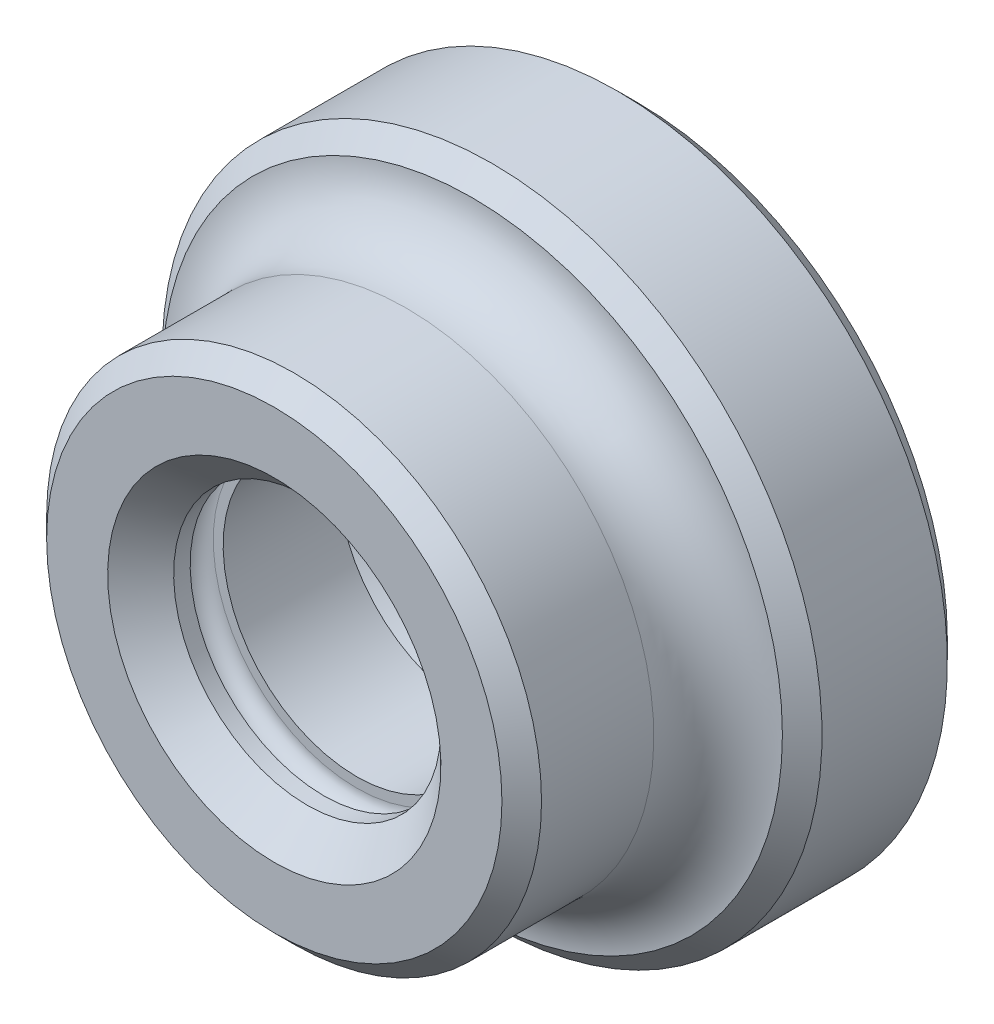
ISO-10303-21;
HEADER;
FILE_DESCRIPTION(('STEP AP214'),'2;1');
FILE_NAME('part.step','',(''),(''),'','','');
FILE_SCHEMA(('AUTOMOTIVE_DESIGN { 1 0 10303 214 1 1 1 1 }'));
ENDSEC;
DATA;
#1=APPLICATION_CONTEXT('core data for automotive mechanical design processes');
#2=APPLICATION_PROTOCOL_DEFINITION('international standard','automotive_design',2000,#1);
#3=PRODUCT_CONTEXT('',#1,'mechanical');
#4=PRODUCT('Part','Part','',(#3));
#5=PRODUCT_RELATED_PRODUCT_CATEGORY('part','',(#4));
#6=PRODUCT_DEFINITION_FORMATION('','',#4);
#7=PRODUCT_DEFINITION_CONTEXT('part definition',#1,'design');
#8=PRODUCT_DEFINITION('design','',#6,#7);
#9=PRODUCT_DEFINITION_SHAPE('','',#8);
#10=(LENGTH_UNIT() NAMED_UNIT(*) SI_UNIT(.MILLI.,.METRE.));
#11=(NAMED_UNIT(*) PLANE_ANGLE_UNIT() SI_UNIT($,.RADIAN.));
#12=(NAMED_UNIT(*) SI_UNIT($,.STERADIAN.) SOLID_ANGLE_UNIT());
#13=UNCERTAINTY_MEASURE_WITH_UNIT(LENGTH_MEASURE(1.E-05),#10,'distance_accuracy_value','');
#14=(GEOMETRIC_REPRESENTATION_CONTEXT(3) GLOBAL_UNCERTAINTY_ASSIGNED_CONTEXT((#13)) GLOBAL_UNIT_ASSIGNED_CONTEXT((#10,
#11,#12)) REPRESENTATION_CONTEXT('',''));
#15=CARTESIAN_POINT('',(0.,0.,0.));
#16=DIRECTION('',(0.,0.,1.));
#17=DIRECTION('',(1.,0.,0.));
#18=AXIS2_PLACEMENT_3D('',#15,#16,#17);
#19=CARTESIAN_POINT('',(0.,0.,4.99999999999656));
#20=DIRECTION('',(0.,0.,1.));
#21=DIRECTION('',(0.,-1.,0.));
#22=AXIS2_PLACEMENT_3D('',#19,#20,#21);
#23=CONICAL_SURFACE('',#22,4.05000000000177,1.02974425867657);
#24=CARTESIAN_POINT('',(0.,2.22044604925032E-13,2.56651449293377));
#25=VERTEX_POINT('',#24);
#26=VERTEX_LOOP('',#25);
#27=FACE_BOUND('',#26,.T.);
#28=CARTESIAN_POINT('',(0.,0.,5.));
#29=DIRECTION('',(0.,0.,1.));
#30=DIRECTION('',(0.,-1.,0.));
#31=AXIS2_PLACEMENT_3D('',#28,#29,#30);
#32=CIRCLE('',#31,4.05);
#33=CARTESIAN_POINT('',(0.,-4.05,5.));
#34=VERTEX_POINT('',#33);
#35=EDGE_CURVE('E30',#34,#34,#32,.T.);
#36=ORIENTED_EDGE('',*,*,#35,.T.);
#37=EDGE_LOOP('',(#36));
#38=FACE_BOUND('',#37,.T.);
#39=ADVANCED_FACE('F14',(#27,#38),#23,.F.);
#40=CARTESIAN_POINT('',(0.,0.,0.));
#41=DIRECTION('',(0.,0.,1.));
#42=DIRECTION('',(0.,-1.,0.));
#43=AXIS2_PLACEMENT_3D('',#40,#41,#42);
#44=CYLINDRICAL_SURFACE('',#43,4.05);
#45=ORIENTED_EDGE('',*,*,#35,.F.);
#46=EDGE_LOOP('',(#45));
#47=FACE_BOUND('',#46,.T.);
#48=CARTESIAN_POINT('',(0.,0.,8.5));
#49=DIRECTION('',(0.,0.,1.));
#50=DIRECTION('',(0.,-1.,0.));
#51=AXIS2_PLACEMENT_3D('',#48,#49,#50);
#52=CIRCLE('',#51,4.05);
#53=CARTESIAN_POINT('',(0.,-4.05,8.5));
#54=VERTEX_POINT('',#53);
#55=EDGE_CURVE('E17',#54,#54,#52,.T.);
#56=ORIENTED_EDGE('',*,*,#55,.T.);
#57=EDGE_LOOP('',(#56));
#58=FACE_BOUND('',#57,.T.);
#59=ADVANCED_FACE('F27',(#47,#58),#44,.F.);
#60=CARTESIAN_POINT('',(4.05,0.,8.5));
#61=DIRECTION('',(0.,0.,-1.));
#62=DIRECTION('',(0.,1.,0.));
#63=AXIS2_PLACEMENT_3D('',#60,#61,#62);
#64=PLANE('',#63);
#65=ORIENTED_EDGE('',*,*,#55,.F.);
#66=EDGE_LOOP('',(#65));
#67=FACE_BOUND('',#66,.T.);
#68=CARTESIAN_POINT('',(0.,0.,8.5));
#69=DIRECTION('',(0.,0.,-1.));
#70=DIRECTION('',(0.,1.,0.));
#71=AXIS2_PLACEMENT_3D('',#68,#69,#70);
#72=CIRCLE('',#71,4.35);
#73=CARTESIAN_POINT('',(0.,4.35,8.5));
#74=VERTEX_POINT('',#73);
#75=EDGE_CURVE('E34',#74,#74,#72,.F.);
#76=ORIENTED_EDGE('',*,*,#75,.T.);
#77=EDGE_LOOP('',(#76));
#78=FACE_BOUND('',#77,.T.);
#79=ADVANCED_FACE('F76',(#67,#78),#64,.F.);
#80=CARTESIAN_POINT('',(0.,0.,9.));
#81=DIRECTION('',(0.,0.,-1.));
#82=DIRECTION('',(0.,1.,0.));
#83=AXIS2_PLACEMENT_3D('',#80,#81,#82);
#84=TOROIDAL_SURFACE('',#83,4.35,0.5);
#85=ORIENTED_EDGE('',*,*,#75,.F.);
#86=EDGE_LOOP('',(#85));
#87=FACE_BOUND('',#86,.T.);
#88=CARTESIAN_POINT('',(0.,0.,9.5));
#89=DIRECTION('',(0.,0.,1.));
#90=DIRECTION('',(0.,1.,0.));
#91=AXIS2_PLACEMENT_3D('',#88,#89,#90);
#92=CIRCLE('',#91,4.35);
#93=CARTESIAN_POINT('',(0.,4.35,9.5));
#94=VERTEX_POINT('',#93);
#95=EDGE_CURVE('E63',#94,#94,#92,.T.);
#96=ORIENTED_EDGE('',*,*,#95,.T.);
#97=EDGE_LOOP('',(#96));
#98=FACE_BOUND('',#97,.T.);
#99=ADVANCED_FACE('F92',(#87,#98),#84,.F.);
#100=CARTESIAN_POINT('',(4.35,0.,9.5));
#101=DIRECTION('',(0.,0.,1.));
#102=DIRECTION('',(0.,-1.,0.));
#103=AXIS2_PLACEMENT_3D('',#100,#101,#102);
#104=PLANE('',#103);
#105=ORIENTED_EDGE('',*,*,#95,.F.);
#106=EDGE_LOOP('',(#105));
#107=FACE_BOUND('',#106,.T.);
#108=CARTESIAN_POINT('',(0.,0.,9.5));
#109=DIRECTION('',(0.,0.,1.));
#110=DIRECTION('',(0.,-1.,0.));
#111=AXIS2_PLACEMENT_3D('',#108,#109,#110);
#112=CIRCLE('',#111,4.05);
#113=CARTESIAN_POINT('',(0.,-4.05,9.5));
#114=VERTEX_POINT('',#113);
#115=EDGE_CURVE('E61',#114,#114,#112,.T.);
#116=ORIENTED_EDGE('',*,*,#115,.T.);
#117=EDGE_LOOP('',(#116));
#118=FACE_BOUND('',#117,.T.);
#119=ADVANCED_FACE('F147',(#107,#118),#104,.F.);
#120=CARTESIAN_POINT('',(0.,0.,0.));
#121=DIRECTION('',(0.,0.,1.));
#122=DIRECTION('',(0.,-1.,0.));
#123=AXIS2_PLACEMENT_3D('',#120,#121,#122);
#124=CYLINDRICAL_SURFACE('',#123,4.05);
#125=ORIENTED_EDGE('',*,*,#115,.F.);
#126=EDGE_LOOP('',(#125));
#127=FACE_BOUND('',#126,.T.);
#128=CARTESIAN_POINT('',(0.,0.,9.99999999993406));
#129=DIRECTION('',(0.,0.,1.));
#130=DIRECTION('',(0.,-1.,0.));
#131=AXIS2_PLACEMENT_3D('',#128,#129,#130);
#132=CIRCLE('',#131,4.05000000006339);
#133=CARTESIAN_POINT('',(0.,-4.05000000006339,9.99999999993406));
#134=VERTEX_POINT('',#133);
#135=EDGE_CURVE('E60',#134,#134,#132,.T.);
#136=ORIENTED_EDGE('',*,*,#135,.T.);
#137=EDGE_LOOP('',(#136));
#138=FACE_BOUND('',#137,.T.);
#139=ADVANCED_FACE('F156',(#127,#138),#124,.F.);
#140=CARTESIAN_POINT('',(0.,0.,10.9999999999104));
#141=DIRECTION('',(0.,0.,1.));
#142=DIRECTION('',(0.,-1.,0.));
#143=AXIS2_PLACEMENT_3D('',#140,#141,#142);
#144=CONICAL_SURFACE('',#143,5.0499999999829,0.785398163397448);
#145=ORIENTED_EDGE('',*,*,#135,.F.);
#146=EDGE_LOOP('',(#145));
#147=FACE_BOUND('',#146,.T.);
#148=CARTESIAN_POINT('',(0.,0.,10.9999999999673));
#149=DIRECTION('',(0.,0.,1.));
#150=DIRECTION('',(0.,-1.,0.));
#151=AXIS2_PLACEMENT_3D('',#148,#149,#150);
#152=CIRCLE('',#151,5.05000000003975);
#153=CARTESIAN_POINT('',(0.,-5.05000000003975,10.9999999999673));
#154=VERTEX_POINT('',#153);
#155=EDGE_CURVE('E58',#154,#154,#152,.T.);
#156=ORIENTED_EDGE('',*,*,#155,.T.);
#157=EDGE_LOOP('',(#156));
#158=FACE_BOUND('',#157,.T.);
#159=ADVANCED_FACE('F159',(#147,#158),#144,.F.);
#160=CARTESIAN_POINT('',(5.05,0.,11.));
#161=DIRECTION('',(0.,0.,-1.));
#162=DIRECTION('',(0.,1.,0.));
#163=AXIS2_PLACEMENT_3D('',#160,#161,#162);
#164=PLANE('',#163);
#165=ORIENTED_EDGE('',*,*,#155,.F.);
#166=EDGE_LOOP('',(#165));
#167=FACE_BOUND('',#166,.T.);
#168=CARTESIAN_POINT('',(0.,0.,11.0000000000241));
#169=DIRECTION('',(0.,0.,-1.));
#170=DIRECTION('',(0.,1.,0.));
#171=AXIS2_PLACEMENT_3D('',#168,#169,#170);
#172=CIRCLE('',#171,6.89999999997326);
#173=CARTESIAN_POINT('',(0.,6.89999999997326,11.0000000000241));
#174=VERTEX_POINT('',#173);
#175=EDGE_CURVE('E55',#174,#174,#172,.T.);
#176=ORIENTED_EDGE('',*,*,#175,.F.);
#177=EDGE_LOOP('',(#176));
#178=FACE_BOUND('',#177,.T.);
#179=ADVANCED_FACE('F163',(#167,#178),#164,.F.);
#180=CARTESIAN_POINT('',(0.,0.,0.5));
#181=DIRECTION('',(0.,0.,-1.));
#182=DIRECTION('',(0.,1.,0.));
#183=AXIS2_PLACEMENT_3D('',#180,#181,#182);
#184=PLANE('',#183);
#185=CARTESIAN_POINT('',(0.,0.,0.5));
#186=DIRECTION('',(0.,0.,1.));
#187=DIRECTION('',(0.,-1.,0.));
#188=AXIS2_PLACEMENT_3D('',#185,#186,#187);
#189=CIRCLE('',#188,4.);
#190=CARTESIAN_POINT('',(0.,-4.,0.5));
#191=VERTEX_POINT('',#190);
#192=EDGE_CURVE('E52',#191,#191,#189,.F.);
#193=ORIENTED_EDGE('',*,*,#192,.T.);
#194=EDGE_LOOP('',(#193));
#195=FACE_BOUND('',#194,.T.);
#196=ADVANCED_FACE('F167',(#195),#184,.T.);
#197=CARTESIAN_POINT('',(0.,0.,10.4000000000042));
#198=DIRECTION('',(0.,0.,-1.));
#199=DIRECTION('',(0.,1.,0.));
#200=AXIS2_PLACEMENT_3D('',#197,#198,#199);
#201=CONICAL_SURFACE('',#200,7.49999999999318,0.785398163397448);
#202=ORIENTED_EDGE('',*,*,#175,.T.);
#203=EDGE_LOOP('',(#202));
#204=FACE_BOUND('',#203,.T.);
#205=CARTESIAN_POINT('',(0.,0.,10.4));
#206=DIRECTION('',(0.,0.,1.));
#207=DIRECTION('',(0.,-1.,0.));
#208=AXIS2_PLACEMENT_3D('',#205,#206,#207);
#209=CIRCLE('',#208,7.5);
#210=CARTESIAN_POINT('',(0.,-7.5,10.4));
#211=VERTEX_POINT('',#210);
#212=EDGE_CURVE('E51',#211,#211,#209,.F.);
#213=ORIENTED_EDGE('',*,*,#212,.F.);
#214=EDGE_LOOP('',(#213));
#215=FACE_BOUND('',#214,.T.);
#216=ADVANCED_FACE('F171',(#204,#215),#201,.T.);
#217=CARTESIAN_POINT('',(0.,0.,0.));
#218=DIRECTION('',(0.,0.,1.));
#219=DIRECTION('',(0.,-1.,0.));
#220=AXIS2_PLACEMENT_3D('',#217,#218,#219);
#221=CYLINDRICAL_SURFACE('',#220,4.);
#222=ORIENTED_EDGE('',*,*,#192,.F.);
#223=EDGE_LOOP('',(#222));
#224=FACE_BOUND('',#223,.T.);
#225=CARTESIAN_POINT('',(0.,0.,0.));
#226=DIRECTION('',(0.,0.,1.));
#227=DIRECTION('',(0.,-1.,0.));
#228=AXIS2_PLACEMENT_3D('',#225,#226,#227);
#229=CIRCLE('',#228,4.);
#230=CARTESIAN_POINT('',(0.,-4.,0.));
#231=VERTEX_POINT('',#230);
#232=EDGE_CURVE('E48',#231,#231,#229,.F.);
#233=ORIENTED_EDGE('',*,*,#232,.T.);
#234=EDGE_LOOP('',(#233));
#235=FACE_BOUND('',#234,.T.);
#236=ADVANCED_FACE('F175',(#224,#235),#221,.F.);
#237=CARTESIAN_POINT('',(0.,0.,0.));
#238=DIRECTION('',(0.,0.,1.));
#239=DIRECTION('',(0.,-1.,0.));
#240=AXIS2_PLACEMENT_3D('',#237,#238,#239);
#241=CYLINDRICAL_SURFACE('',#240,7.5);
#242=ORIENTED_EDGE('',*,*,#212,.T.);
#243=EDGE_LOOP('',(#242));
#244=FACE_BOUND('',#243,.T.);
#245=CARTESIAN_POINT('',(0.,0.,6.99749843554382));
#246=DIRECTION('',(0.,0.,-1.));
#247=DIRECTION('',(0.,1.,0.));
#248=AXIS2_PLACEMENT_3D('',#245,#246,#247);
#249=CIRCLE('',#248,7.5);
#250=CARTESIAN_POINT('',(0.,7.5,6.99749843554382));
#251=VERTEX_POINT('',#250);
#252=EDGE_CURVE('E47',#251,#251,#249,.F.);
#253=ORIENTED_EDGE('',*,*,#252,.T.);
#254=EDGE_LOOP('',(#253));
#255=FACE_BOUND('',#254,.T.);
#256=ADVANCED_FACE('F178',(#244,#255),#241,.T.);
#257=CARTESIAN_POINT('',(9.4,0.,0.));
#258=DIRECTION('',(0.,0.,1.));
#259=DIRECTION('',(0.,-1.,0.));
#260=AXIS2_PLACEMENT_3D('',#257,#258,#259);
#261=PLANE('',#260);
#262=CARTESIAN_POINT('',(0.,0.,0.));
#263=DIRECTION('',(0.,0.,1.));
#264=DIRECTION('',(0.,-1.,0.));
#265=AXIS2_PLACEMENT_3D('',#262,#263,#264);
#266=CIRCLE('',#265,9.4);
#267=CARTESIAN_POINT('',(0.,-9.4,0.));
#268=VERTEX_POINT('',#267);
#269=EDGE_CURVE('E43',#268,#268,#266,.T.);
#270=ORIENTED_EDGE('',*,*,#269,.F.);
#271=EDGE_LOOP('',(#270));
#272=FACE_BOUND('',#271,.T.);
#273=ORIENTED_EDGE('',*,*,#232,.F.);
#274=EDGE_LOOP('',(#273));
#275=FACE_BOUND('',#274,.T.);
#276=ADVANCED_FACE('F124',(#272,#275),#261,.F.);
#277=CARTESIAN_POINT('',(0.,0.,6.99749843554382));
#278=DIRECTION('',(0.,0.,-1.));
#279=DIRECTION('',(0.,1.,0.));
#280=AXIS2_PLACEMENT_3D('',#277,#278,#279);
#281=TOROIDAL_SURFACE('',#280,9.5,2.);
#282=ORIENTED_EDGE('',*,*,#252,.F.);
#283=EDGE_LOOP('',(#282));
#284=FACE_BOUND('',#283,.T.);
#285=CARTESIAN_POINT('',(0.,0.,5.));
#286=DIRECTION('',(0.,0.,-1.));
#287=DIRECTION('',(0.,1.,0.));
#288=AXIS2_PLACEMENT_3D('',#285,#286,#287);
#289=CIRCLE('',#288,9.4);
#290=CARTESIAN_POINT('',(0.,9.4,5.));
#291=VERTEX_POINT('',#290);
#292=EDGE_CURVE('E46',#291,#291,#289,.T.);
#293=ORIENTED_EDGE('',*,*,#292,.F.);
#294=EDGE_LOOP('',(#293));
#295=FACE_BOUND('',#294,.T.);
#296=ADVANCED_FACE('F119',(#284,#295),#281,.F.);
#297=CARTESIAN_POINT('',(0.,0.,0.6));
#298=DIRECTION('',(0.,0.,1.));
#299=DIRECTION('',(0.,-1.,0.));
#300=AXIS2_PLACEMENT_3D('',#297,#298,#299);
#301=CONICAL_SURFACE('',#300,10.,0.785398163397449);
#302=CARTESIAN_POINT('',(0.,0.,0.6));
#303=DIRECTION('',(0.,0.,1.));
#304=DIRECTION('',(0.,-1.,0.));
#305=AXIS2_PLACEMENT_3D('',#302,#303,#304);
#306=CIRCLE('',#305,10.);
#307=CARTESIAN_POINT('',(0.,-10.,0.6));
#308=VERTEX_POINT('',#307);
#309=EDGE_CURVE('E21',#308,#308,#306,.T.);
#310=ORIENTED_EDGE('',*,*,#309,.F.);
#311=EDGE_LOOP('',(#310));
#312=FACE_BOUND('',#311,.T.);
#313=ORIENTED_EDGE('',*,*,#269,.T.);
#314=EDGE_LOOP('',(#313));
#315=FACE_BOUND('',#314,.T.);
#316=ADVANCED_FACE('F112',(#312,#315),#301,.T.);
#317=CARTESIAN_POINT('',(0.,0.,4.4));
#318=DIRECTION('',(0.,0.,-1.));
#319=DIRECTION('',(0.,1.,0.));
#320=AXIS2_PLACEMENT_3D('',#317,#318,#319);
#321=CONICAL_SURFACE('',#320,10.,0.785398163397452);
#322=ORIENTED_EDGE('',*,*,#292,.T.);
#323=EDGE_LOOP('',(#322));
#324=FACE_BOUND('',#323,.T.);
#325=CARTESIAN_POINT('',(0.,0.,4.4));
#326=DIRECTION('',(0.,0.,1.));
#327=DIRECTION('',(0.,-1.,0.));
#328=AXIS2_PLACEMENT_3D('',#325,#326,#327);
#329=CIRCLE('',#328,10.);
#330=CARTESIAN_POINT('',(0.,-10.,4.4));
#331=VERTEX_POINT('',#330);
#332=EDGE_CURVE('E9',#331,#331,#329,.F.);
#333=ORIENTED_EDGE('',*,*,#332,.F.);
#334=EDGE_LOOP('',(#333));
#335=FACE_BOUND('',#334,.T.);
#336=ADVANCED_FACE('F105',(#324,#335),#321,.T.);
#337=CARTESIAN_POINT('',(0.,0.,0.));
#338=DIRECTION('',(0.,0.,1.));
#339=DIRECTION('',(0.,-1.,0.));
#340=AXIS2_PLACEMENT_3D('',#337,#338,#339);
#341=CYLINDRICAL_SURFACE('',#340,10.);
#342=ORIENTED_EDGE('',*,*,#332,.T.);
#343=EDGE_LOOP('',(#342));
#344=FACE_BOUND('',#343,.T.);
#345=ORIENTED_EDGE('',*,*,#309,.T.);
#346=EDGE_LOOP('',(#345));
#347=FACE_BOUND('',#346,.T.);
#348=ADVANCED_FACE('F103',(#344,#347),#341,.T.);
#349=CLOSED_SHELL('',(#39,#59,#79,#99,#119,#139,#159,#179,#196,#216,#236,#256,#276,#296,#316,
#336,#348));
#350=MANIFOLD_SOLID_BREP('B1',#349);
#351=ADVANCED_BREP_SHAPE_REPRESENTATION('',(#18,#350),#14);
#352=SHAPE_DEFINITION_REPRESENTATION(#9,#351);
ENDSEC;
END-ISO-10303-21;
